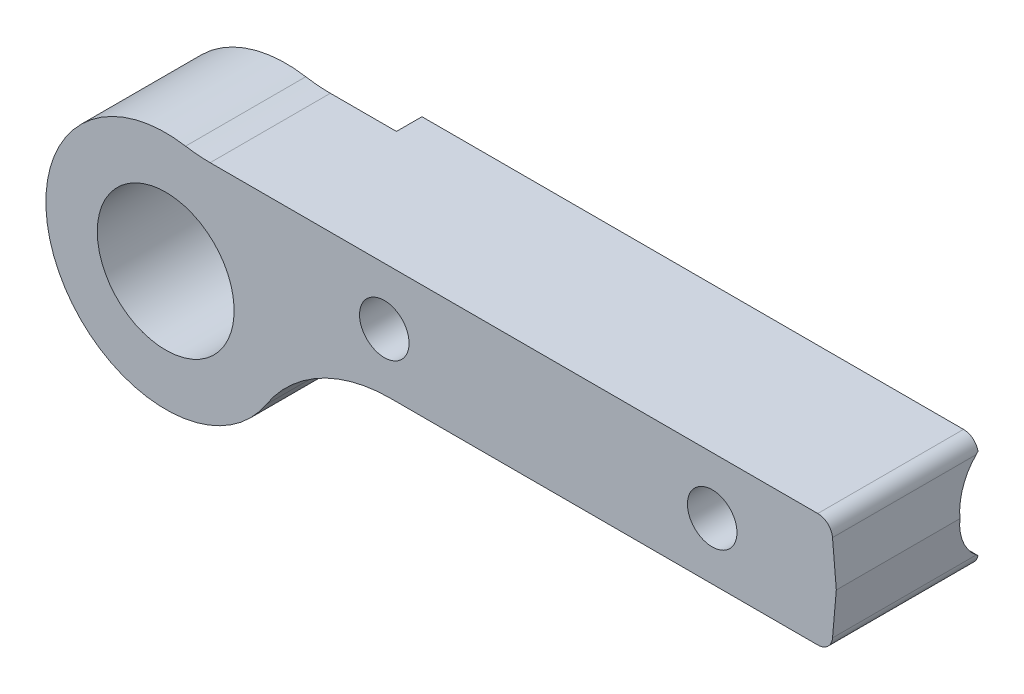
ISO-10303-21;
HEADER;
FILE_DESCRIPTION(('STEP AP214'),'2;1');
FILE_NAME('part.step','',(''),(''),'','','');
FILE_SCHEMA(('AUTOMOTIVE_DESIGN { 1 0 10303 214 1 1 1 1 }'));
ENDSEC;
DATA;
#1=APPLICATION_CONTEXT('core data for automotive mechanical design processes');
#2=APPLICATION_PROTOCOL_DEFINITION('international standard','automotive_design',2000,#1);
#3=PRODUCT_CONTEXT('',#1,'mechanical');
#4=PRODUCT('Part','Part','',(#3));
#5=PRODUCT_RELATED_PRODUCT_CATEGORY('part','',(#4));
#6=PRODUCT_DEFINITION_FORMATION('','',#4);
#7=PRODUCT_DEFINITION_CONTEXT('part definition',#1,'design');
#8=PRODUCT_DEFINITION('design','',#6,#7);
#9=PRODUCT_DEFINITION_SHAPE('','',#8);
#10=(LENGTH_UNIT() NAMED_UNIT(*) SI_UNIT(.MILLI.,.METRE.));
#11=(NAMED_UNIT(*) PLANE_ANGLE_UNIT() SI_UNIT($,.RADIAN.));
#12=(NAMED_UNIT(*) SI_UNIT($,.STERADIAN.) SOLID_ANGLE_UNIT());
#13=UNCERTAINTY_MEASURE_WITH_UNIT(LENGTH_MEASURE(1.E-05),#10,'distance_accuracy_value','');
#14=(GEOMETRIC_REPRESENTATION_CONTEXT(3) GLOBAL_UNCERTAINTY_ASSIGNED_CONTEXT((#13)) GLOBAL_UNIT_ASSIGNED_CONTEXT((#10,
#11,#12)) REPRESENTATION_CONTEXT('',''));
#15=CARTESIAN_POINT('',(0.,0.,0.));
#16=DIRECTION('',(0.,0.,1.));
#17=DIRECTION('',(1.,0.,0.));
#18=AXIS2_PLACEMENT_3D('',#15,#16,#17);
#19=CARTESIAN_POINT('',(30.8284770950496,-19.995,0.));
#20=DIRECTION('',(0.,0.,1.));
#21=DIRECTION('',(1.,0.,0.));
#22=AXIS2_PLACEMENT_3D('',#19,#20,#21);
#23=PLANE('',#22);
#24=CARTESIAN_POINT('',(0.,0.,0.));
#25=DIRECTION('',(0.,0.,-1.));
#26=DIRECTION('',(-1.,0.,0.));
#27=AXIS2_PLACEMENT_3D('',#24,#25,#26);
#28=CIRCLE('',#27,22.);
#29=CARTESIAN_POINT('',(21.9152168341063,1.92957796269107,0.));
#30=VERTEX_POINT('',#29);
#31=CARTESIAN_POINT('',(21.9303605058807,-1.74908206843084,0.));
#32=VERTEX_POINT('',#31);
#33=EDGE_CURVE('E145',#30,#32,#28,.T.);
#34=ORIENTED_EDGE('',*,*,#33,.F.);
#35=DIRECTION('',(1.,0.,0.));
#36=VECTOR('',#35,1.);
#37=CARTESIAN_POINT('',(-16.445,1.92957796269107,0.));
#38=LINE('',#37,#36);
#39=CARTESIAN_POINT('',(91.4789512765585,1.92957796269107,0.));
#40=VERTEX_POINT('',#39);
#41=EDGE_CURVE('E51',#30,#40,#38,.T.);
#42=ORIENTED_EDGE('',*,*,#41,.T.);
#43=CARTESIAN_POINT('',(89.4898477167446,2.335,0.));
#44=DIRECTION('',(0.,0.,1.));
#45=DIRECTION('',(1.,0.,0.));
#46=AXIS2_PLACEMENT_3D('',#43,#44,#45);
#47=CIRCLE('',#46,2.03);
#48=CARTESIAN_POINT('',(89.4898477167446,0.305,0.));
#49=VERTEX_POINT('',#48);
#50=EDGE_CURVE('E171',#49,#40,#47,.T.);
#51=ORIENTED_EDGE('',*,*,#50,.F.);
#52=DIRECTION('',(1.,0.,0.));
#53=VECTOR('',#52,1.);
#54=CARTESIAN_POINT('',(30.8284770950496,0.305,0.));
#55=LINE('',#54,#53);
#56=CARTESIAN_POINT('',(30.8284770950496,0.305,0.));
#57=VERTEX_POINT('',#56);
#58=EDGE_CURVE('E169',#57,#49,#55,.T.);
#59=ORIENTED_EDGE('',*,*,#58,.F.);
#60=CARTESIAN_POINT('',(30.8284770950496,-19.995,0.));
#61=DIRECTION('',(0.,0.,-1.));
#62=DIRECTION('',(1.,0.,0.));
#63=AXIS2_PLACEMENT_3D('',#60,#61,#62);
#64=CIRCLE('',#63,20.3);
#65=EDGE_CURVE('E167',#32,#57,#64,.T.);
#66=ORIENTED_EDGE('',*,*,#65,.F.);
#67=EDGE_LOOP('',(#34,#42,#51,#59,#66));
#68=FACE_BOUND('',#67,.T.);
#69=ADVANCED_FACE('F30',(#68),#23,.F.);
#70=CARTESIAN_POINT('',(6.10080322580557,36.235,20.));
#71=DIRECTION('',(0.,0.,-1.));
#72=DIRECTION('',(-1.,0.,0.));
#73=AXIS2_PLACEMENT_3D('',#70,#71,#72);
#74=CYLINDRICAL_SURFACE('',#73,20.3);
#75=CARTESIAN_POINT('',(6.10080322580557,36.235,3.5));
#76=DIRECTION('',(0.,0.,-1.));
#77=DIRECTION('',(-1.,0.,0.));
#78=AXIS2_PLACEMENT_3D('',#75,#76,#77);
#79=CIRCLE('',#78,20.3);
#80=CARTESIAN_POINT('',(2.73037716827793,16.216752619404,3.5));
#81=VERTEX_POINT('',#80);
#82=CARTESIAN_POINT('',(6.10080322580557,15.935,3.5));
#83=VERTEX_POINT('',#82);
#84=EDGE_CURVE('E161',#81,#83,#79,.F.);
#85=ORIENTED_EDGE('',*,*,#84,.F.);
#86=DIRECTION('',(0.,0.,-1.));
#87=VECTOR('',#86,1.);
#88=CARTESIAN_POINT('',(2.73037716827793,16.216752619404,20.));
#89=LINE('',#88,#87);
#90=CARTESIAN_POINT('',(2.73037716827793,16.216752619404,20.));
#91=VERTEX_POINT('',#90);
#92=EDGE_CURVE('E199',#91,#81,#89,.T.);
#93=ORIENTED_EDGE('',*,*,#92,.F.);
#94=CARTESIAN_POINT('',(6.10080322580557,36.235,20.));
#95=DIRECTION('',(0.,0.,-1.));
#96=DIRECTION('',(1.,0.,0.));
#97=AXIS2_PLACEMENT_3D('',#94,#95,#96);
#98=CIRCLE('',#97,20.3);
#99=CARTESIAN_POINT('',(6.10080322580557,15.935,20.));
#100=VERTEX_POINT('',#99);
#101=EDGE_CURVE('E192',#100,#91,#98,.T.);
#102=ORIENTED_EDGE('',*,*,#101,.F.);
#103=DIRECTION('',(0.,0.,-1.));
#104=VECTOR('',#103,1.);
#105=CARTESIAN_POINT('',(6.10080322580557,15.935,20.));
#106=LINE('',#105,#104);
#107=EDGE_CURVE('E202',#100,#83,#106,.T.);
#108=ORIENTED_EDGE('',*,*,#107,.T.);
#109=EDGE_LOOP('',(#85,#93,#102,#108));
#110=FACE_BOUND('',#109,.T.);
#111=ADVANCED_FACE('F280',(#110),#74,.F.);
#112=CARTESIAN_POINT('',(0.,0.,20.));
#113=DIRECTION('',(0.,0.,-1.));
#114=DIRECTION('',(-1.,0.,0.));
#115=AXIS2_PLACEMENT_3D('',#112,#113,#114);
#116=CYLINDRICAL_SURFACE('',#115,16.445);
#117=CARTESIAN_POINT('',(0.,0.,3.5));
#118=DIRECTION('',(0.,0.,-1.));
#119=DIRECTION('',(-1.,0.,0.));
#120=AXIS2_PLACEMENT_3D('',#117,#118,#119);
#121=CIRCLE('',#120,16.445);
#122=CARTESIAN_POINT('',(13.7970963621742,-8.94863995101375,3.5));
#123=VERTEX_POINT('',#122);
#124=EDGE_CURVE('E43',#123,#81,#121,.T.);
#125=ORIENTED_EDGE('',*,*,#124,.F.);
#126=DIRECTION('',(0.,0.,-1.));
#127=VECTOR('',#126,1.);
#128=CARTESIAN_POINT('',(13.7970963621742,-8.94863995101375,20.));
#129=LINE('',#128,#127);
#130=CARTESIAN_POINT('',(13.7970963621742,-8.94863995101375,20.));
#131=VERTEX_POINT('',#130);
#132=EDGE_CURVE('E196',#131,#123,#129,.T.);
#133=ORIENTED_EDGE('',*,*,#132,.F.);
#134=CARTESIAN_POINT('',(0.,0.,20.));
#135=DIRECTION('',(0.,0.,1.));
#136=DIRECTION('',(1.,0.,0.));
#137=AXIS2_PLACEMENT_3D('',#134,#135,#136);
#138=CIRCLE('',#137,16.445);
#139=EDGE_CURVE('E194',#91,#131,#138,.T.);
#140=ORIENTED_EDGE('',*,*,#139,.F.);
#141=ORIENTED_EDGE('',*,*,#92,.T.);
#142=EDGE_LOOP('',(#125,#133,#140,#141));
#143=FACE_BOUND('',#142,.T.);
#144=ADVANCED_FACE('F277',(#143),#116,.T.);
#145=CARTESIAN_POINT('',(30.8284770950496,-19.995,20.));
#146=DIRECTION('',(0.,0.,-1.));
#147=DIRECTION('',(-1.,0.,0.));
#148=AXIS2_PLACEMENT_3D('',#145,#146,#147);
#149=CYLINDRICAL_SURFACE('',#148,20.3);
#150=CARTESIAN_POINT('',(30.8284770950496,-19.995,3.5));
#151=DIRECTION('',(0.,0.,-1.));
#152=DIRECTION('',(-1.,0.,0.));
#153=AXIS2_PLACEMENT_3D('',#150,#151,#152);
#154=CIRCLE('',#153,20.3);
#155=CARTESIAN_POINT('',(21.9303605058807,-1.74908206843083,3.5));
#156=VERTEX_POINT('',#155);
#157=EDGE_CURVE('E165',#156,#123,#154,.F.);
#158=ORIENTED_EDGE('',*,*,#157,.F.);
#159=DIRECTION('',(0.,0.,-1.));
#160=VECTOR('',#159,1.);
#161=CARTESIAN_POINT('',(21.9303605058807,-1.74908206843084,1.75));
#162=LINE('',#161,#160);
#163=EDGE_CURVE('E158',#156,#32,#162,.T.);
#164=ORIENTED_EDGE('',*,*,#163,.T.);
#165=ORIENTED_EDGE('',*,*,#65,.T.);
#166=DIRECTION('',(0.,0.,-1.));
#167=VECTOR('',#166,1.);
#168=CARTESIAN_POINT('',(30.8284770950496,0.305,20.));
#169=LINE('',#168,#167);
#170=CARTESIAN_POINT('',(30.8284770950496,0.305,20.));
#171=VERTEX_POINT('',#170);
#172=EDGE_CURVE('E220',#171,#57,#169,.T.);
#173=ORIENTED_EDGE('',*,*,#172,.F.);
#174=CARTESIAN_POINT('',(30.8284770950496,-19.995,20.));
#175=DIRECTION('',(0.,0.,-1.));
#176=DIRECTION('',(1.,0.,0.));
#177=AXIS2_PLACEMENT_3D('',#174,#175,#176);
#178=CIRCLE('',#177,20.3);
#179=EDGE_CURVE('E177',#131,#171,#178,.T.);
#180=ORIENTED_EDGE('',*,*,#179,.F.);
#181=ORIENTED_EDGE('',*,*,#132,.T.);
#182=EDGE_LOOP('',(#158,#164,#165,#173,#180,#181));
#183=FACE_BOUND('',#182,.T.);
#184=ADVANCED_FACE('F32',(#183),#149,.F.);
#185=CARTESIAN_POINT('',(30.8284770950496,0.305,20.));
#186=DIRECTION('',(0.,1.,0.));
#187=DIRECTION('',(0.,0.,1.));
#188=AXIS2_PLACEMENT_3D('',#185,#186,#187);
#189=PLANE('',#188);
#190=ORIENTED_EDGE('',*,*,#58,.T.);
#191=DIRECTION('',(0.,0.,-1.));
#192=VECTOR('',#191,1.);
#193=CARTESIAN_POINT('',(89.4898477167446,0.305,20.));
#194=LINE('',#193,#192);
#195=CARTESIAN_POINT('',(89.4898477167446,0.305,20.));
#196=VERTEX_POINT('',#195);
#197=EDGE_CURVE('E217',#196,#49,#194,.T.);
#198=ORIENTED_EDGE('',*,*,#197,.F.);
#199=DIRECTION('',(1.,0.,0.));
#200=VECTOR('',#199,1.);
#201=CARTESIAN_POINT('',(30.8284770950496,0.305,20.));
#202=LINE('',#201,#200);
#203=EDGE_CURVE('E180',#171,#196,#202,.T.);
#204=ORIENTED_EDGE('',*,*,#203,.F.);
#205=ORIENTED_EDGE('',*,*,#172,.T.);
#206=EDGE_LOOP('',(#190,#198,#204,#205));
#207=FACE_BOUND('',#206,.T.);
#208=ADVANCED_FACE('F270',(#207),#189,.F.);
#209=CARTESIAN_POINT('',(89.4898477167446,2.335,20.));
#210=DIRECTION('',(0.,0.,-1.));
#211=DIRECTION('',(-1.,0.,0.));
#212=AXIS2_PLACEMENT_3D('',#209,#210,#211);
#213=CYLINDRICAL_SURFACE('',#212,2.03);
#214=ORIENTED_EDGE('',*,*,#50,.T.);
#215=CARTESIAN_POINT('',(91.4789512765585,1.92957796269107,0.));
#216=CARTESIAN_POINT('',(91.4827079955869,1.94800984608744,0.0239206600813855));
#217=CARTESIAN_POINT('',(91.4862300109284,1.96659848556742,0.0477578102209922));
#218=CARTESIAN_POINT('',(91.4927834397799,2.00407655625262,0.0952461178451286));
#219=CARTESIAN_POINT('',(91.4958150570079,2.0229658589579,0.11889734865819));
#220=CARTESIAN_POINT('',(91.5013696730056,2.06104800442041,0.166014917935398));
#221=CARTESIAN_POINT('',(91.5038926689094,2.08024084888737,0.189481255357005));
#222=CARTESIAN_POINT('',(91.5084100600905,2.11893179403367,0.23622878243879));
#223=CARTESIAN_POINT('',(91.5104042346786,2.13843001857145,0.259509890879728));
#224=CARTESIAN_POINT('',(91.5121229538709,2.15807384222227,0.28268854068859));
#225=B_SPLINE_CURVE_WITH_KNOTS('',3,(#215,#216,#217,#218,#219,#220,#221,#222,#223,#224),
.UNSPECIFIED.,.F.,.F.,(4,2,2,2,4),(0.,0.0912920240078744,0.18254602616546,0.273800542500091,
0.365093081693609),.UNSPECIFIED.);
#226=CARTESIAN_POINT('',(91.5121229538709,2.15807384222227,0.282688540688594));
#227=VERTEX_POINT('',#226);
#228=EDGE_CURVE('E149',#40,#227,#225,.T.);
#229=ORIENTED_EDGE('',*,*,#228,.T.);
#230=DIRECTION('',(0.,0.,-1.));
#231=VECTOR('',#230,1.);
#232=CARTESIAN_POINT('',(91.5121229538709,2.15807384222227,20.));
#233=LINE('',#232,#231);
#234=CARTESIAN_POINT('',(91.5121229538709,2.15807384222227,20.));
#235=VERTEX_POINT('',#234);
#236=EDGE_CURVE('E214',#235,#227,#233,.T.);
#237=ORIENTED_EDGE('',*,*,#236,.F.);
#238=CARTESIAN_POINT('',(89.4898477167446,2.335,20.));
#239=DIRECTION('',(0.,0.,1.));
#240=DIRECTION('',(1.,0.,0.));
#241=AXIS2_PLACEMENT_3D('',#238,#239,#240);
#242=CIRCLE('',#241,2.03);
#243=EDGE_CURVE('E182',#196,#235,#242,.T.);
#244=ORIENTED_EDGE('',*,*,#243,.F.);
#245=ORIENTED_EDGE('',*,*,#197,.T.);
#246=EDGE_LOOP('',(#214,#229,#237,#244,#245));
#247=FACE_BOUND('',#246,.T.);
#248=ADVANCED_FACE('F266',(#247),#213,.T.);
#249=CARTESIAN_POINT('',(91.5121229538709,2.15807384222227,20.));
#250=DIRECTION('',(-0.996194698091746,0.0871557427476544,0.));
#251=DIRECTION('',(-0.0871557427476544,-0.996194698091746,0.));
#252=AXIS2_PLACEMENT_3D('',#249,#250,#251);
#253=PLANE('',#252);
#254=ORIENTED_EDGE('',*,*,#236,.T.);
#255=CARTESIAN_POINT('',(92.0337239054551,8.12,-4.77));
#256=DIRECTION('',(-0.996194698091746,0.0871557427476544,0.));
#257=DIRECTION('',(0.0871557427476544,0.996194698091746,0.));
#258=AXIS2_PLACEMENT_3D('',#255,#256,#257);
#259=ELLIPSE('',#258,7.84485203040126,7.815);
#260=CARTESIAN_POINT('',(92.0337239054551,8.12,3.04500000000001));
#261=VERTEX_POINT('',#260);
#262=EDGE_CURVE('E328',#227,#261,#259,.T.);
#263=ORIENTED_EDGE('',*,*,#262,.T.);
#264=DIRECTION('',(0.,0.,-1.));
#265=VECTOR('',#264,1.);
#266=CARTESIAN_POINT('',(92.0337239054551,8.12,20.));
#267=LINE('',#266,#265);
#268=CARTESIAN_POINT('',(92.0337239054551,8.12,20.));
#269=VERTEX_POINT('',#268);
#270=EDGE_CURVE('E211',#269,#261,#267,.T.);
#271=ORIENTED_EDGE('',*,*,#270,.F.);
#272=DIRECTION('',(0.0871557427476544,0.996194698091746,0.));
#273=VECTOR('',#272,1.);
#274=CARTESIAN_POINT('',(91.5121229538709,2.15807384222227,20.));
#275=LINE('',#274,#273);
#276=EDGE_CURVE('E184',#235,#269,#275,.T.);
#277=ORIENTED_EDGE('',*,*,#276,.F.);
#278=EDGE_LOOP('',(#254,#263,#271,#277));
#279=FACE_BOUND('',#278,.T.);
#280=ADVANCED_FACE('F263',(#279),#253,.F.);
#281=CARTESIAN_POINT('',(91.5121229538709,14.0819261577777,20.));
#282=DIRECTION('',(-0.996194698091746,-0.0871557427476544,0.));
#283=DIRECTION('',(0.0871557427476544,-0.996194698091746,0.));
#284=AXIS2_PLACEMENT_3D('',#281,#282,#283);
#285=PLANE('',#284);
#286=ORIENTED_EDGE('',*,*,#270,.T.);
#287=CARTESIAN_POINT('',(92.0337239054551,8.12,-4.77));
#288=DIRECTION('',(-0.996194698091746,-0.0871557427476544,0.));
#289=DIRECTION('',(0.0871557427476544,-0.996194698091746,0.));
#290=AXIS2_PLACEMENT_3D('',#287,#288,#289);
#291=ELLIPSE('',#290,7.84485203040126,7.815);
#292=CARTESIAN_POINT('',(91.5121229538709,14.0819261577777,0.282688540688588));
#293=VERTEX_POINT('',#292);
#294=EDGE_CURVE('E251',#261,#293,#291,.T.);
#295=ORIENTED_EDGE('',*,*,#294,.T.);
#296=DIRECTION('',(0.,0.,-1.));
#297=VECTOR('',#296,1.);
#298=CARTESIAN_POINT('',(91.5121229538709,14.0819261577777,20.));
#299=LINE('',#298,#297);
#300=CARTESIAN_POINT('',(91.5121229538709,14.0819261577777,20.));
#301=VERTEX_POINT('',#300);
#302=EDGE_CURVE('E208',#301,#293,#299,.T.);
#303=ORIENTED_EDGE('',*,*,#302,.F.);
#304=DIRECTION('',(-0.0871557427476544,0.996194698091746,0.));
#305=VECTOR('',#304,1.);
#306=CARTESIAN_POINT('',(91.5121229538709,14.0819261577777,20.));
#307=LINE('',#306,#305);
#308=EDGE_CURVE('E186',#269,#301,#307,.T.);
#309=ORIENTED_EDGE('',*,*,#308,.F.);
#310=EDGE_LOOP('',(#286,#295,#303,#309));
#311=FACE_BOUND('',#310,.T.);
#312=ADVANCED_FACE('F258',(#311),#285,.F.);
#313=CARTESIAN_POINT('',(89.4898477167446,13.905,20.));
#314=DIRECTION('',(0.,0.,-1.));
#315=DIRECTION('',(-1.,0.,0.));
#316=AXIS2_PLACEMENT_3D('',#313,#314,#315);
#317=CYLINDRICAL_SURFACE('',#316,2.03);
#318=ORIENTED_EDGE('',*,*,#302,.T.);
#319=CARTESIAN_POINT('',(91.5121229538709,14.0819261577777,0.282688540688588));
#320=CARTESIAN_POINT('',(91.5104042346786,14.1015699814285,0.259509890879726));
#321=CARTESIAN_POINT('',(91.5084100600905,14.1210682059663,0.236228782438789));
#322=CARTESIAN_POINT('',(91.5038926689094,14.1597591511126,0.189481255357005));
#323=CARTESIAN_POINT('',(91.5013696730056,14.1789519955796,0.166014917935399));
#324=CARTESIAN_POINT('',(91.4958150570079,14.2170341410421,0.118897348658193));
#325=CARTESIAN_POINT('',(91.4927834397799,14.2359234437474,0.0952461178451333));
#326=CARTESIAN_POINT('',(91.4862300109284,14.2734015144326,0.0477578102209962));
#327=CARTESIAN_POINT('',(91.482707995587,14.2919901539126,0.0239206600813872));
#328=CARTESIAN_POINT('',(91.4789512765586,14.3104220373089,0.));
#329=B_SPLINE_CURVE_WITH_KNOTS('',3,(#319,#320,#321,#322,#323,#324,#325,#326,#327,#328),
.UNSPECIFIED.,.F.,.F.,(4,2,2,2,4),(0.,0.0912925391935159,0.182547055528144,0.273801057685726,
0.3650930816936),.UNSPECIFIED.);
#330=CARTESIAN_POINT('',(91.4789512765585,14.3104220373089,0.));
#331=VERTEX_POINT('',#330);
#332=EDGE_CURVE('E244',#293,#331,#329,.T.);
#333=ORIENTED_EDGE('',*,*,#332,.T.);
#334=CARTESIAN_POINT('',(89.4898477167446,13.905,0.));
#335=DIRECTION('',(0.,0.,1.));
#336=DIRECTION('',(-1.,0.,0.));
#337=AXIS2_PLACEMENT_3D('',#334,#335,#336);
#338=CIRCLE('',#337,2.03);
#339=CARTESIAN_POINT('',(89.4898477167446,15.935,0.));
#340=VERTEX_POINT('',#339);
#341=EDGE_CURVE('E140',#331,#340,#338,.T.);
#342=ORIENTED_EDGE('',*,*,#341,.T.);
#343=DIRECTION('',(0.,0.,-1.));
#344=VECTOR('',#343,1.);
#345=CARTESIAN_POINT('',(89.4898477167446,15.935,20.));
#346=LINE('',#345,#344);
#347=CARTESIAN_POINT('',(89.4898477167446,15.935,20.));
#348=VERTEX_POINT('',#347);
#349=EDGE_CURVE('E205',#348,#340,#346,.T.);
#350=ORIENTED_EDGE('',*,*,#349,.F.);
#351=CARTESIAN_POINT('',(89.4898477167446,13.905,20.));
#352=DIRECTION('',(0.,0.,1.));
#353=DIRECTION('',(-1.,0.,0.));
#354=AXIS2_PLACEMENT_3D('',#351,#352,#353);
#355=CIRCLE('',#354,2.03);
#356=EDGE_CURVE('E188',#301,#348,#355,.T.);
#357=ORIENTED_EDGE('',*,*,#356,.F.);
#358=EDGE_LOOP('',(#318,#333,#342,#350,#357));
#359=FACE_BOUND('',#358,.T.);
#360=ADVANCED_FACE('F252',(#359),#317,.T.);
#361=CARTESIAN_POINT('',(6.10080322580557,15.935,20.));
#362=DIRECTION('',(0.,-1.,0.));
#363=DIRECTION('',(0.,0.,-1.));
#364=AXIS2_PLACEMENT_3D('',#361,#362,#363);
#365=PLANE('',#364);
#366=DIRECTION('',(-1.,0.,0.));
#367=VECTOR('',#366,1.);
#368=CARTESIAN_POINT('',(6.10080322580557,15.935,0.));
#369=LINE('',#368,#367);
#370=CARTESIAN_POINT('',(15.1682489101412,15.935,0.));
#371=VERTEX_POINT('',#370);
#372=EDGE_CURVE('E175',#340,#371,#369,.T.);
#373=ORIENTED_EDGE('',*,*,#372,.T.);
#374=DIRECTION('',(0.,0.,-1.));
#375=VECTOR('',#374,1.);
#376=CARTESIAN_POINT('',(15.1682489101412,15.935,3.5));
#377=LINE('',#376,#375);
#378=CARTESIAN_POINT('',(15.1682489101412,15.935,3.5));
#379=VERTEX_POINT('',#378);
#380=EDGE_CURVE('E58',#371,#379,#377,.F.);
#381=ORIENTED_EDGE('',*,*,#380,.T.);
#382=DIRECTION('',(1.,0.,0.));
#383=VECTOR('',#382,1.);
#384=CARTESIAN_POINT('',(6.10080322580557,15.935,3.5));
#385=LINE('',#384,#383);
#386=EDGE_CURVE('E163',#83,#379,#385,.T.);
#387=ORIENTED_EDGE('',*,*,#386,.F.);
#388=ORIENTED_EDGE('',*,*,#107,.F.);
#389=DIRECTION('',(-1.,0.,0.));
#390=VECTOR('',#389,1.);
#391=CARTESIAN_POINT('',(6.10080322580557,15.935,20.));
#392=LINE('',#391,#390);
#393=EDGE_CURVE('E190',#348,#100,#392,.T.);
#394=ORIENTED_EDGE('',*,*,#393,.F.);
#395=ORIENTED_EDGE('',*,*,#349,.T.);
#396=EDGE_LOOP('',(#373,#381,#387,#388,#394,#395));
#397=FACE_BOUND('',#396,.T.);
#398=ADVANCED_FACE('F257',(#397),#365,.F.);
#399=CARTESIAN_POINT('',(30.8284770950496,-19.995,20.));
#400=DIRECTION('',(0.,0.,1.));
#401=DIRECTION('',(1.,0.,0.));
#402=AXIS2_PLACEMENT_3D('',#399,#400,#401);
#403=PLANE('',#402);
#404=CARTESIAN_POINT('',(30.,8.12,20.));
#405=DIRECTION('',(0.,0.,1.));
#406=DIRECTION('',(1.,0.,0.));
#407=AXIS2_PLACEMENT_3D('',#404,#405,#406);
#408=CIRCLE('',#407,3.39999999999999);
#409=CARTESIAN_POINT('',(33.4,8.12,20.));
#410=VERTEX_POINT('',#409);
#411=EDGE_CURVE('E443',#410,#410,#408,.T.);
#412=ORIENTED_EDGE('',*,*,#411,.F.);
#413=EDGE_LOOP('',(#412));
#414=FACE_BOUND('',#413,.T.);
#415=CARTESIAN_POINT('',(75.,8.12,20.));
#416=DIRECTION('',(0.,0.,1.));
#417=DIRECTION('',(1.,0.,0.));
#418=AXIS2_PLACEMENT_3D('',#415,#416,#417);
#419=CIRCLE('',#418,3.39999999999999);
#420=CARTESIAN_POINT('',(78.4,8.12,20.));
#421=VERTEX_POINT('',#420);
#422=EDGE_CURVE('E446',#421,#421,#419,.T.);
#423=ORIENTED_EDGE('',*,*,#422,.F.);
#424=EDGE_LOOP('',(#423));
#425=FACE_BOUND('',#424,.T.);
#426=CARTESIAN_POINT('',(0.,0.,20.));
#427=DIRECTION('',(0.,0.,-1.));
#428=DIRECTION('',(-1.,0.,0.));
#429=AXIS2_PLACEMENT_3D('',#426,#427,#428);
#430=CIRCLE('',#429,9.39);
#431=CARTESIAN_POINT('',(-9.39,0.,20.));
#432=VERTEX_POINT('',#431);
#433=EDGE_CURVE('E141',#432,#432,#430,.T.);
#434=ORIENTED_EDGE('',*,*,#433,.T.);
#435=EDGE_LOOP('',(#434));
#436=FACE_BOUND('',#435,.T.);
#437=ORIENTED_EDGE('',*,*,#179,.T.);
#438=ORIENTED_EDGE('',*,*,#203,.T.);
#439=ORIENTED_EDGE('',*,*,#243,.T.);
#440=ORIENTED_EDGE('',*,*,#276,.T.);
#441=ORIENTED_EDGE('',*,*,#308,.T.);
#442=ORIENTED_EDGE('',*,*,#356,.T.);
#443=ORIENTED_EDGE('',*,*,#393,.T.);
#444=ORIENTED_EDGE('',*,*,#101,.T.);
#445=ORIENTED_EDGE('',*,*,#139,.T.);
#446=EDGE_LOOP('',(#437,#438,#439,#440,#441,#442,#443,#444,#445));
#447=FACE_BOUND('',#446,.T.);
#448=ADVANCED_FACE('F288',(#414,#425,#436,#447),#403,.T.);
#449=ORIENTED_EDGE('',*,*,#341,.F.);
#450=DIRECTION('',(1.,0.,0.));
#451=VECTOR('',#450,1.);
#452=CARTESIAN_POINT('',(-16.445,14.3104220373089,0.));
#453=LINE('',#452,#451);
#454=CARTESIAN_POINT('',(16.7096325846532,14.3104220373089,0.));
#455=VERTEX_POINT('',#454);
#456=EDGE_CURVE('E131',#331,#455,#453,.F.);
#457=ORIENTED_EDGE('',*,*,#456,.T.);
#458=EDGE_CURVE('E138',#371,#455,#28,.T.);
#459=ORIENTED_EDGE('',*,*,#458,.F.);
#460=ORIENTED_EDGE('',*,*,#372,.F.);
#461=EDGE_LOOP('',(#449,#457,#459,#460));
#462=FACE_BOUND('',#461,.T.);
#463=ADVANCED_FACE('F136',(#462),#23,.F.);
#464=CARTESIAN_POINT('',(0.,0.,3.5));
#465=DIRECTION('',(0.,0.,-1.));
#466=DIRECTION('',(-1.,0.,0.));
#467=AXIS2_PLACEMENT_3D('',#464,#465,#466);
#468=PLANE('',#467);
#469=CARTESIAN_POINT('',(0.,0.,3.5));
#470=DIRECTION('',(0.,0.,-1.));
#471=DIRECTION('',(-1.,0.,0.));
#472=AXIS2_PLACEMENT_3D('',#469,#470,#471);
#473=CIRCLE('',#472,9.39);
#474=CARTESIAN_POINT('',(-9.39,0.,3.5));
#475=VERTEX_POINT('',#474);
#476=EDGE_CURVE('E451',#475,#475,#473,.T.);
#477=ORIENTED_EDGE('',*,*,#476,.F.);
#478=EDGE_LOOP('',(#477));
#479=FACE_BOUND('',#478,.T.);
#480=ORIENTED_EDGE('',*,*,#157,.T.);
#481=ORIENTED_EDGE('',*,*,#124,.T.);
#482=ORIENTED_EDGE('',*,*,#84,.T.);
#483=ORIENTED_EDGE('',*,*,#386,.T.);
#484=CARTESIAN_POINT('',(0.,0.,3.5));
#485=DIRECTION('',(0.,0.,-1.));
#486=DIRECTION('',(-1.,0.,0.));
#487=AXIS2_PLACEMENT_3D('',#484,#485,#486);
#488=CIRCLE('',#487,22.);
#489=EDGE_CURVE('E144',#379,#156,#488,.T.);
#490=ORIENTED_EDGE('',*,*,#489,.T.);
#491=EDGE_LOOP('',(#480,#481,#482,#483,#490));
#492=FACE_BOUND('',#491,.T.);
#493=ADVANCED_FACE('F238',(#479,#492),#468,.T.);
#494=CARTESIAN_POINT('',(0.,0.,3.5));
#495=DIRECTION('',(0.,0.,-1.));
#496=DIRECTION('',(-1.,0.,0.));
#497=AXIS2_PLACEMENT_3D('',#494,#495,#496);
#498=CYLINDRICAL_SURFACE('',#497,22.);
#499=ORIENTED_EDGE('',*,*,#458,.T.);
#500=CARTESIAN_POINT('',(20.4466525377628,8.12,-12.585));
#501=CARTESIAN_POINT('',(20.3510161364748,8.36081444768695,-12.5849987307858));
#502=CARTESIAN_POINT('',(20.251106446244,8.59996062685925,-12.5738600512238));
#503=CARTESIAN_POINT('',(20.0436542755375,9.07296381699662,-12.5303176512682));
#504=CARTESIAN_POINT('',(19.9361099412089,9.30681952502,-12.4979087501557));
#505=CARTESIAN_POINT('',(19.7143688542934,9.76775861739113,-12.4129099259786));
#506=CARTESIAN_POINT('',(19.6001682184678,9.99483792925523,-12.3603081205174));
#507=CARTESIAN_POINT('',(19.366248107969,10.4408758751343,-12.2360156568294));
#508=CARTESIAN_POINT('',(19.2465264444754,10.6598312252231,-12.1643173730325));
#509=CARTESIAN_POINT('',(19.0035339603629,11.0871888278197,-12.0033834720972));
#510=CARTESIAN_POINT('',(18.8802891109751,11.2956470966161,-11.9142570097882));
#511=CARTESIAN_POINT('',(18.6307896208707,11.7025913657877,-11.7191142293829));
#512=CARTESIAN_POINT('',(18.5045350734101,11.9010776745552,-11.6130984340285));
#513=CARTESIAN_POINT('',(18.250160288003,12.2876049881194,-11.3848116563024));
#514=CARTESIAN_POINT('',(18.1220380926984,12.4756338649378,-11.2625223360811));
#515=CARTESIAN_POINT('',(17.8655012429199,12.8403099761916,-11.0024194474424));
#516=CARTESIAN_POINT('',(17.737086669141,13.0169600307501,-10.8646097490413));
#517=CARTESIAN_POINT('',(17.4669484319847,13.377669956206,-10.5573529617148));
#518=CARTESIAN_POINT('',(17.3253678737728,13.5602963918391,-10.3860903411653));
#519=CARTESIAN_POINT('',(17.046088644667,13.9097414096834,-10.025117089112));
#520=CARTESIAN_POINT('',(16.9083909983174,14.0765558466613,-9.83540164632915));
#521=CARTESIAN_POINT('',(16.6399937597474,14.392829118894,-9.43799671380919));
#522=CARTESIAN_POINT('',(16.5092831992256,14.5423156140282,-9.23033681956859));
#523=CARTESIAN_POINT('',(16.2582115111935,14.8224811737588,-8.79710149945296));
#524=CARTESIAN_POINT('',(16.1378438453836,14.9531721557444,-8.5715375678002));
#525=CARTESIAN_POINT('',(15.8821697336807,15.2249742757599,-8.04161826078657));
#526=CARTESIAN_POINT('',(15.7510556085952,15.3600329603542,-7.73197659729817));
#527=CARTESIAN_POINT('',(15.5793608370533,15.5335183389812,-7.24857173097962));
#528=CARTESIAN_POINT('',(15.5262970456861,15.5864915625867,-7.08430138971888));
#529=CARTESIAN_POINT('',(15.4298210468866,15.6820030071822,-6.75002638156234));
#530=CARTESIAN_POINT('',(15.3864038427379,15.7245466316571,-6.58002473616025));
#531=CARTESIAN_POINT('',(15.3100868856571,15.7988646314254,-6.23323726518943));
#532=CARTESIAN_POINT('',(15.2773117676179,15.8305116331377,-6.05639642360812));
#533=CARTESIAN_POINT('',(15.2241227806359,15.8816704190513,-5.69911312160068));
#534=CARTESIAN_POINT('',(15.203708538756,15.9011825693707,-5.51867077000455));
#535=CARTESIAN_POINT('',(15.1760549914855,15.9275775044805,-5.15599190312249));
#536=CARTESIAN_POINT('',(15.1688055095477,15.9344700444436,-4.97375688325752));
#537=CARTESIAN_POINT('',(15.1677543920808,15.9354708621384,-4.60922286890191));
#538=CARTESIAN_POINT('',(15.1739512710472,15.9295805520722,-4.42692388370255));
#539=CARTESIAN_POINT('',(15.1976443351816,15.906973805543,-4.09077631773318));
#540=CARTESIAN_POINT('',(15.2133485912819,15.8919732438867,-3.93667912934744));
#541=CARTESIAN_POINT('',(15.2538950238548,15.8530589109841,-3.63079004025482));
#542=CARTESIAN_POINT('',(15.278739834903,15.8291425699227,-3.47899881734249));
#543=CARTESIAN_POINT('',(15.336913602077,15.7727840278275,-3.1786217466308));
#544=CARTESIAN_POINT('',(15.3702453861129,15.7403389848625,-3.03003698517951));
#545=CARTESIAN_POINT('',(15.4445913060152,15.6673963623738,-2.7368072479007));
#546=CARTESIAN_POINT('',(15.4856072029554,15.6268969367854,-2.59216318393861));
#547=CARTESIAN_POINT('',(15.589827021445,15.5230285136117,-2.25809514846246));
#548=CARTESIAN_POINT('',(15.6557991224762,15.4565939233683,-2.07048118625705));
#549=CARTESIAN_POINT('',(15.7979670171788,15.3112561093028,-1.70423708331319));
#550=CARTESIAN_POINT('',(15.8741633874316,15.2323521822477,-1.52560745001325));
#551=CARTESIAN_POINT('',(16.0349680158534,15.0629829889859,-1.17740100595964));
#552=CARTESIAN_POINT('',(16.1195923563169,14.9724955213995,-1.00784249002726));
#553=CARTESIAN_POINT('',(16.2953600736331,14.7810061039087,-0.678357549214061));
#554=CARTESIAN_POINT('',(16.3865036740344,14.6800037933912,-0.518431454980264));
#555=CARTESIAN_POINT('',(16.6037295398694,14.4343661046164,-0.158662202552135));
#556=CARTESIAN_POINT('',(16.7316655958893,14.2861049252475,0.037595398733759));
#557=CARTESIAN_POINT('',(16.9932443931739,13.973945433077,0.413164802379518));
#558=CARTESIAN_POINT('',(17.1268888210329,13.810042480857,0.592471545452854));
#559=CARTESIAN_POINT('',(17.3974424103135,13.4676141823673,0.934010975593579));
#560=CARTESIAN_POINT('',(17.5343529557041,13.2890825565,1.09623626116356));
#561=CARTESIAN_POINT('',(17.809248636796,12.9183558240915,1.40316040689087));
#562=CARTESIAN_POINT('',(17.9472336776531,12.7261619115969,1.54786079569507));
#563=CARTESIAN_POINT('',(18.2240125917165,12.3266014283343,1.82074524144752));
#564=CARTESIAN_POINT('',(18.3627975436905,12.1190859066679,1.94872043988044));
#565=CARTESIAN_POINT('',(18.6378203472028,11.6917157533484,2.1853375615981));
#566=CARTESIAN_POINT('',(18.7740583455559,11.471861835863,2.29398060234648));
#567=CARTESIAN_POINT('',(19.0423393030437,11.0208051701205,2.49085989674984));
#568=CARTESIAN_POINT('',(19.1743832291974,10.7896050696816,2.57910088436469));
#569=CARTESIAN_POINT('',(19.4327689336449,10.3169768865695,2.73395536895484));
#570=CARTESIAN_POINT('',(19.5591108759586,10.0755490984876,2.8005694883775));
#571=CARTESIAN_POINT('',(19.804356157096,9.58449829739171,2.91066574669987));
#572=CARTESIAN_POINT('',(19.9232761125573,9.33489564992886,2.95420132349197));
#573=CARTESIAN_POINT('',(20.1526573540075,8.82879221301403,3.01696642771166));
#574=CARTESIAN_POINT('',(20.2631184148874,8.57229124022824,3.03619530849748));
#575=CARTESIAN_POINT('',(20.4742825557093,8.05492025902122,3.04900764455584));
#576=CARTESIAN_POINT('',(20.5749946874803,7.79405457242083,3.04261512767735));
#577=CARTESIAN_POINT('',(20.7657862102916,7.27046781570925,3.00312041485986));
#578=CARTESIAN_POINT('',(20.8558677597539,7.00774713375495,2.97002365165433));
#579=CARTESIAN_POINT('',(21.012640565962,6.52109398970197,2.88309041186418));
#580=CARTESIAN_POINT('',(21.080834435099,6.29698905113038,2.83289805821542));
#581=CARTESIAN_POINT('',(21.2087104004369,5.85185441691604,2.71217198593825));
#582=CARTESIAN_POINT('',(21.2683934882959,5.63082436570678,2.64164064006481));
#583=CARTESIAN_POINT('',(21.3792237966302,5.19418094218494,2.48037601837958));
#584=CARTESIAN_POINT('',(21.4303750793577,4.97856503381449,2.38965240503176));
#585=CARTESIAN_POINT('',(21.5244024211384,4.55490704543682,2.18839927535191));
#586=CARTESIAN_POINT('',(21.5672789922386,4.34686449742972,2.07787098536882));
#587=CARTESIAN_POINT('',(21.6413000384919,3.96091020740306,1.8497663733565));
#588=CARTESIAN_POINT('',(21.673189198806,3.78206668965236,1.73400236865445));
#589=CARTESIAN_POINT('',(21.7310846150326,3.43381958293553,1.48774795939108));
#590=CARTESIAN_POINT('',(21.7570911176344,3.26441559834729,1.35725817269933));
#591=CARTESIAN_POINT('',(21.8037736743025,2.93647615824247,1.08244155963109));
#592=CARTESIAN_POINT('',(21.8244502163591,2.77793970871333,0.938116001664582));
#593=CARTESIAN_POINT('',(21.8611041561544,2.47299727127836,0.636621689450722));
#594=CARTESIAN_POINT('',(21.877081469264,2.32659150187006,0.4794527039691));
#595=CARTESIAN_POINT('',(21.9048540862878,2.04857948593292,0.155159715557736));
#596=CARTESIAN_POINT('',(21.9166929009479,1.91682984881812,-0.0118377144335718));
#597=CARTESIAN_POINT('',(21.9370905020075,1.66725737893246,-0.356206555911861));
#598=CARTESIAN_POINT('',(21.9456481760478,1.54943927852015,-0.533581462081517));
#599=CARTESIAN_POINT('',(21.9601219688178,1.32864135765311,-0.897410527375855));
#600=CARTESIAN_POINT('',(21.9660383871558,1.22565985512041,-1.08386365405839));
#601=CARTESIAN_POINT('',(21.9758362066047,1.03523757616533,-1.46459922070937));
#602=CARTESIAN_POINT('',(21.979717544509,0.947797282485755,-1.65888190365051));
#603=CARTESIAN_POINT('',(21.9860539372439,0.78740904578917,-2.05807077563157));
#604=CARTESIAN_POINT('',(21.9884776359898,0.714800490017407,-2.26311389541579));
#605=CARTESIAN_POINT('',(21.9922627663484,0.586919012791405,-2.67855208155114));
#606=CARTESIAN_POINT('',(21.9936241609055,0.531646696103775,-2.88894733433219));
#607=CARTESIAN_POINT('',(21.9956718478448,0.438835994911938,-3.31357739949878));
#608=CARTESIAN_POINT('',(21.996358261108,0.401294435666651,-3.52781151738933));
#609=CARTESIAN_POINT('',(21.9973261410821,0.344180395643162,-3.95875482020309));
#610=CARTESIAN_POINT('',(21.9976074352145,0.324615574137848,-4.17546502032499));
#611=CARTESIAN_POINT('',(21.9979088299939,0.303515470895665,-4.61190472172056));
#612=CARTESIAN_POINT('',(21.9979263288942,0.302159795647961,-4.83164292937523));
#613=CARTESIAN_POINT('',(21.9977037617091,0.317947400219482,-5.27036133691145));
#614=CARTESIAN_POINT('',(21.9974638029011,0.335082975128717,-5.48934181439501));
#615=CARTESIAN_POINT('',(21.9965988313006,0.387726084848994,-5.92514086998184));
#616=CARTESIAN_POINT('',(21.9959737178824,0.423238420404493,-6.14195886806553));
#617=CARTESIAN_POINT('',(21.994077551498,0.512384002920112,-6.57182861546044));
#618=CARTESIAN_POINT('',(21.9928065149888,0.566016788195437,-6.78488046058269));
#619=CARTESIAN_POINT('',(21.9892322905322,0.691068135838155,-7.20586732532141));
#620=CARTESIAN_POINT('',(21.9869283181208,0.762500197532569,-7.41379832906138));
#621=CARTESIAN_POINT('',(21.980791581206,0.922613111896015,-7.82288258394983));
#622=CARTESIAN_POINT('',(21.9769588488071,1.01129360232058,-8.02403597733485));
#623=CARTESIAN_POINT('',(21.9671740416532,1.2052768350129,-8.41816101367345));
#624=CARTESIAN_POINT('',(21.9612215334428,1.31058297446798,-8.61113097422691));
#625=CARTESIAN_POINT('',(21.9465386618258,1.53697644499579,-8.98736983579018));
#626=CARTESIAN_POINT('',(21.9378093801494,1.65805761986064,-9.17064248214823));
#627=CARTESIAN_POINT('',(21.9169185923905,1.91445339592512,-9.52531864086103));
#628=CARTESIAN_POINT('',(21.904774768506,2.04969247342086,-9.6967777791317));
#629=CARTESIAN_POINT('',(21.8763232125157,2.33385170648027,-10.0275904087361));
#630=CARTESIAN_POINT('',(21.8600154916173,2.48277182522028,-10.186943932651));
#631=CARTESIAN_POINT('',(21.82253858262,2.79306645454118,-10.4923584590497));
#632=CARTESIAN_POINT('',(21.8013701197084,2.95443910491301,-10.6384214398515));
#633=CARTESIAN_POINT('',(21.7535161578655,3.28830719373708,-10.9162287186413));
#634=CARTESIAN_POINT('',(21.7268307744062,3.46080239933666,-11.0479733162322));
#635=CARTESIAN_POINT('',(21.6679504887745,3.81195304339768,-11.29380167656));
#636=CARTESIAN_POINT('',(21.6358738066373,3.99042151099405,-11.4081809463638));
#637=CARTESIAN_POINT('',(21.5654227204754,4.35511492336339,-11.6216057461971));
#638=CARTESIAN_POINT('',(21.5270483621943,4.54133981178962,-11.7206513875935));
#639=CARTESIAN_POINT('',(21.4436968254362,4.91989996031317,-11.9028605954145));
#640=CARTESIAN_POINT('',(21.3987217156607,5.11223329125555,-11.9860291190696));
#641=CARTESIAN_POINT('',(21.3019799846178,5.50144063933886,-12.1361982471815));
#642=CARTESIAN_POINT('',(21.2502136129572,5.69831448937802,-12.203199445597));
#643=CARTESIAN_POINT('',(21.1440076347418,6.08006580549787,-12.316489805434));
#644=CARTESIAN_POINT('',(21.0900614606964,6.26473263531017,-12.3639572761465));
#645=CARTESIAN_POINT('',(20.9763951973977,6.63539233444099,-12.4450353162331));
#646=CARTESIAN_POINT('',(20.9166732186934,6.82138561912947,-12.4786413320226));
#647=CARTESIAN_POINT('',(20.7916447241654,7.19347129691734,-12.5321582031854));
#648=CARTESIAN_POINT('',(20.7263378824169,7.3795636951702,-12.5520682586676));
#649=CARTESIAN_POINT('',(20.5904048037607,7.75076260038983,-12.5784905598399));
#650=CARTESIAN_POINT('',(20.519777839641,7.93586896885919,-12.5850009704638));
#651=CARTESIAN_POINT('',(20.4466525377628,8.12,-12.585));
#652=B_SPLINE_CURVE_WITH_KNOTS('',3,(#500,#501,#502,#503,#504,#505,#506,#507,#508,#509,#510,
#511,#512,#513,#514,#515,#516,#517,#518,#519,#520,#521,#522,#523,#524,#525,#526,#527,#528,#529,
#530,#531,#532,#533,#534,#535,#536,#537,#538,#539,#540,#541,#542,#543,#544,#545,#546,#547,#548,
#549,#550,#551,#552,#553,#554,#555,#556,#557,#558,#559,#560,#561,#562,#563,#564,#565,#566,#567,
#568,#569,#570,#571,#572,#573,#574,#575,#576,#577,#578,#579,#580,#581,#582,#583,#584,#585,#586,
#587,#588,#589,#590,#591,#592,#593,#594,#595,#596,#597,#598,#599,#600,#601,#602,#603,#604,#605,
#606,#607,#608,#609,#610,#611,#612,#613,#614,#615,#616,#617,#618,#619,#620,#621,#622,#623,#624,
#625,#626,#627,#628,#629,#630,#631,#632,#633,#634,#635,#636,#637,#638,#639,#640,#641,#642,#643,
#644,#645,#646,#647,#648,#649,#650,#651),.UNSPECIFIED.,.T.,.F.,(4,2,2,2,2,2,2,2,2,2,2,2,2,2,2,2,
2,2,2,2,2,2,2,2,2,2,2,2,2,2,2,2,2,2,2,2,2,2,2,2,2,2,2,2,2,2,2,2,2,2,2,2,2,2,2,2,2,2,2,2,2,2,2,2,
2,2,2,2,2,2,2,2,2,2,2,4),(0.,0.777120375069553,1.55443010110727,2.3321979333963,
3.11027680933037,3.88363014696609,4.65695955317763,5.43116788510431,6.20518359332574,
7.06702164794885,7.92908501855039,8.78975279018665,9.64987242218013,10.7325285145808,
11.2737215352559,11.8146335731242,12.3616693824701,12.9086886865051,13.4552849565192,
14.001820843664,14.4681399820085,14.9345936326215,15.4012029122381,15.8679192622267,
16.496015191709,17.1241465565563,17.7535003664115,18.3828757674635,19.2134756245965,
20.0443226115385,20.8755281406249,21.7066611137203,22.5473430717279,23.3879764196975,
24.2284145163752,25.068828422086,25.9072877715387,26.7457694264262,27.5834649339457,
28.4209900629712,29.1387061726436,29.8563385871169,30.5736283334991,31.29087367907,
31.9363396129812,32.5817784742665,33.2271582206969,33.8725495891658,34.5109356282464,
35.1495378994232,35.7880677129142,36.4266173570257,37.0784529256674,37.7303112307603,
38.3820527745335,39.0340718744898,39.6925175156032,40.350688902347,41.009032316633,
41.6673589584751,42.3261864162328,42.9850000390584,43.6439484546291,44.302640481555,
44.9579823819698,45.6133225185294,46.2685649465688,46.9237936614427,47.5661816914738,
48.2085650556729,48.8507475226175,49.4929063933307,50.0867955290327,50.680879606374,
51.2749983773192,51.8691985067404),.UNSPECIFIED.);
#653=EDGE_CURVE('E11',#455,#30,#652,.T.);
#654=ORIENTED_EDGE('',*,*,#653,.T.);
#655=ORIENTED_EDGE('',*,*,#33,.T.);
#656=ORIENTED_EDGE('',*,*,#163,.F.);
#657=ORIENTED_EDGE('',*,*,#489,.F.);
#658=ORIENTED_EDGE('',*,*,#380,.F.);
#659=EDGE_LOOP('',(#499,#654,#655,#656,#657,#658));
#660=FACE_BOUND('',#659,.T.);
#661=ADVANCED_FACE('F143',(#660),#498,.F.);
#662=CARTESIAN_POINT('',(-16.445,8.12,-4.77));
#663=DIRECTION('',(1.,0.,0.));
#664=DIRECTION('',(0.,0.,-1.));
#665=AXIS2_PLACEMENT_3D('',#662,#663,#664);
#666=CYLINDRICAL_SURFACE('',#665,7.815);
#667=CARTESIAN_POINT('',(33.4,8.12,3.045));
#668=CARTESIAN_POINT('',(33.3999992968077,8.21074674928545,3.04499942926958));
#669=CARTESIAN_POINT('',(33.3963619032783,8.30151946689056,3.04341505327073));
#670=CARTESIAN_POINT('',(33.3818486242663,8.48241256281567,3.03711752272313));
#671=CARTESIAN_POINT('',(33.3709684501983,8.57253252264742,3.03240251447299));
#672=CARTESIAN_POINT('',(33.3420540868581,8.75159312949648,3.01995367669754));
#673=CARTESIAN_POINT('',(33.324006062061,8.84053114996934,3.01221400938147));
#674=CARTESIAN_POINT('',(33.280951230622,9.01642252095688,2.99392251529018));
#675=CARTESIAN_POINT('',(33.2559415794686,9.10337504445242,2.98336953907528));
#676=CARTESIAN_POINT('',(33.1710305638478,9.3596783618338,2.94796423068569));
#677=CARTESIAN_POINT('',(33.1011101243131,9.52530913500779,2.91930381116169));
#678=CARTESIAN_POINT('',(32.9369773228,9.84222982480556,2.85459183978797));
#679=CARTESIAN_POINT('',(32.8427711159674,9.99352336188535,2.81854216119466));
#680=CARTESIAN_POINT('',(32.6273797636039,10.2859720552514,2.74044548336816));
#681=CARTESIAN_POINT('',(32.5050964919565,10.4262638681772,2.69819084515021));
#682=CARTESIAN_POINT('',(32.2393569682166,10.6850974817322,2.61329859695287));
#683=CARTESIAN_POINT('',(32.0958886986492,10.8036268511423,2.57066078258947));
#684=CARTESIAN_POINT('',(31.7823467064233,11.0220146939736,2.48720033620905));
#685=CARTESIAN_POINT('',(31.6112463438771,11.1204955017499,2.44660492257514));
#686=CARTESIAN_POINT('',(31.2528972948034,11.2868930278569,2.37515745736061));
#687=CARTESIAN_POINT('',(31.0656577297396,11.3548268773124,2.34429994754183));
#688=CARTESIAN_POINT('',(30.6902932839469,11.454552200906,2.29808923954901));
#689=CARTESIAN_POINT('',(30.5027036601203,11.4880147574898,2.28202367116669));
#690=CARTESIAN_POINT('',(30.1239376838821,11.5230502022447,2.26518965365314));
#691=CARTESIAN_POINT('',(29.9327636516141,11.5246430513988,2.26441162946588));
#692=CARTESIAN_POINT('',(29.5696293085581,11.4971443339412,2.2776433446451));
#693=CARTESIAN_POINT('',(29.3974172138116,11.4706497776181,2.29040157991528));
#694=CARTESIAN_POINT('',(29.0601827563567,11.3921141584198,2.32713697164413));
#695=CARTESIAN_POINT('',(28.8951619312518,11.3400676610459,2.35111651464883));
#696=CARTESIAN_POINT('',(28.5726453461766,11.210876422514,2.40814520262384));
#697=CARTESIAN_POINT('',(28.415396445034,11.1332024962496,2.44138305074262));
#698=CARTESIAN_POINT('',(28.1155175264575,10.9553393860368,2.51314894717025));
#699=CARTESIAN_POINT('',(27.9728935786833,10.8551409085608,2.55167917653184));
#700=CARTESIAN_POINT('',(27.6923614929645,10.6241572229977,2.63403874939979));
#701=CARTESIAN_POINT('',(27.5561232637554,10.4913949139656,2.67802779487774));
#702=CARTESIAN_POINT('',(27.3072555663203,10.204513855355,2.76335321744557));
#703=CARTESIAN_POINT('',(27.1946326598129,10.0503891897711,2.80468885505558));
#704=CARTESIAN_POINT('',(26.9934355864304,9.7196922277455,2.88145456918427));
#705=CARTESIAN_POINT('',(26.905599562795,9.54262305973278,2.91669324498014));
#706=CARTESIAN_POINT('',(26.7615593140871,9.17429506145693,2.97579769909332));
#707=CARTESIAN_POINT('',(26.7053359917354,8.98304487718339,2.99967034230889));
#708=CARTESIAN_POINT('',(26.6297483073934,8.6056875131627,3.03203458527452));
#709=CARTESIAN_POINT('',(26.6081465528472,8.4201085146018,3.04145795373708));
#710=CARTESIAN_POINT('',(26.5956721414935,8.04775038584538,3.04688106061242));
#711=CARTESIAN_POINT('',(26.6047896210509,7.86097166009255,3.04288510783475));
#712=CARTESIAN_POINT('',(26.6519472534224,7.50238481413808,3.02251438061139));
#713=CARTESIAN_POINT('',(26.6883646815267,7.33031913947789,3.00683441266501));
#714=CARTESIAN_POINT('',(26.7867717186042,6.99496025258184,2.96544282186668));
#715=CARTESIAN_POINT('',(26.8487644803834,6.83166812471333,2.93972996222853));
#716=CARTESIAN_POINT('',(26.9985616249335,6.51270861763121,2.87970662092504));
#717=CARTESIAN_POINT('',(27.0871120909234,6.35743898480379,2.84515257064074));
#718=CARTESIAN_POINT('',(27.2866967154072,6.06340238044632,2.77106487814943));
#719=CARTESIAN_POINT('',(27.3977405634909,5.92464256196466,2.73152909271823));
#720=CARTESIAN_POINT('',(27.6492022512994,5.65623607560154,2.64790785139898));
#721=CARTESIAN_POINT('',(27.7912297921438,5.52812954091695,2.60370728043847));
#722=CARTESIAN_POINT('',(28.0953704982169,5.29708118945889,2.51838524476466));
#723=CARTESIAN_POINT('',(28.2574898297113,5.19414712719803,2.47726473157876));
#724=CARTESIAN_POINT('',(28.6017082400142,5.01465257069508,2.40221959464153));
#725=CARTESIAN_POINT('',(28.7841437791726,4.93866459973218,2.36845646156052));
#726=CARTESIAN_POINT('',(29.1611652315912,4.81918721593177,2.31401360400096));
#727=CARTESIAN_POINT('',(29.3557397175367,4.77566772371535,2.29332177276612));
#728=CARTESIAN_POINT('',(29.7342813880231,4.72547452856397,2.26932702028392));
#729=CARTESIAN_POINT('',(29.9178050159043,4.7160650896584,2.2647340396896));
#730=CARTESIAN_POINT('',(30.2837419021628,4.72692241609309,2.26997807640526));
#731=CARTESIAN_POINT('',(30.466155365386,4.74718352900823,2.27981234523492));
#732=CARTESIAN_POINT('',(30.8142448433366,4.81444300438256,2.31157961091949));
#733=CARTESIAN_POINT('',(30.9802886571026,4.85990130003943,2.33281368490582));
#734=CARTESIAN_POINT('',(31.3023936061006,4.97468210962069,2.38437882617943));
#735=CARTESIAN_POINT('',(31.4584518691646,5.04401145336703,2.41471249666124));
#736=CARTESIAN_POINT('',(31.7668901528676,5.20956358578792,2.48341906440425));
#737=CARTESIAN_POINT('',(31.9184218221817,5.30720333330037,2.52217753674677));
#738=CARTESIAN_POINT('',(32.2038045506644,5.52472402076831,2.60239372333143));
#739=CARTESIAN_POINT('',(32.337648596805,5.64461373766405,2.64385249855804));
#740=CARTESIAN_POINT('',(32.5952142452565,5.91488593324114,2.72889174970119));
#741=CARTESIAN_POINT('',(32.7171947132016,6.06696641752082,2.77236581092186));
#742=CARTESIAN_POINT('',(32.9340903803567,6.39110593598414,2.85318472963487));
#743=CARTESIAN_POINT('',(33.0289932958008,6.5631739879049,2.89052680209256));
#744=CARTESIAN_POINT('',(33.1478707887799,6.83145131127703,2.93856997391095));
#745=CARTESIAN_POINT('',(33.1834354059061,6.92198506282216,2.95318998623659));
#746=CARTESIAN_POINT('',(33.2467734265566,7.10613465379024,2.97951131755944));
#747=CARTESIAN_POINT('',(33.2745505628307,7.19974899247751,2.99121403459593));
#748=CARTESIAN_POINT('',(33.321944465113,7.38911401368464,3.0113290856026));
#749=CARTESIAN_POINT('',(33.3415809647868,7.48485893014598,3.01974937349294));
#750=CARTESIAN_POINT('',(33.3725461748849,7.67787751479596,3.03308241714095));
#751=CARTESIAN_POINT('',(33.3838807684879,7.77515005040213,3.03799765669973));
#752=CARTESIAN_POINT('',(33.3939972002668,7.91387860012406,3.04238996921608));
#753=CARTESIAN_POINT('',(33.3962474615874,7.95506243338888,3.04336803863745));
#754=CARTESIAN_POINT('',(33.3992490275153,8.03749572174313,3.0446731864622));
#755=CARTESIAN_POINT('',(33.4000003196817,8.07874517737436,3.04500025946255));
#756=CARTESIAN_POINT('',(33.4,8.12,3.045));
#757=B_SPLINE_CURVE_WITH_KNOTS('',3,(#667,#668,#669,#670,#671,#672,#673,#674,#675,#676,#677,
#678,#679,#680,#681,#682,#683,#684,#685,#686,#687,#688,#689,#690,#691,#692,#693,#694,#695,#696,
#697,#698,#699,#700,#701,#702,#703,#704,#705,#706,#707,#708,#709,#710,#711,#712,#713,#714,#715,
#716,#717,#718,#719,#720,#721,#722,#723,#724,#725,#726,#727,#728,#729,#730,#731,#732,#733,#734,
#735,#736,#737,#738,#739,#740,#741,#742,#743,#744,#745,#746,#747,#748,#749,#750,#751,#752,#753,
#754,#755,#756),.UNSPECIFIED.,.T.,.F.,(4,2,2,2,2,2,2,2,2,2,2,2,2,2,2,2,2,2,2,2,2,2,2,2,2,2,2,2,
2,2,2,2,2,2,2,2,2,2,2,2,2,2,2,2,4),(0.,0.27219843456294,0.544558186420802,0.817446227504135,
1.09044593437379,1.63393457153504,2.17728559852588,2.74733274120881,3.31770450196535,
3.91930654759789,4.52057078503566,5.09107753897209,5.6612269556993,6.18290723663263,
6.70469851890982,7.23801987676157,7.77156168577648,8.35468502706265,8.93797018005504,
9.5371341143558,10.1359357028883,10.6942039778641,11.2522930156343,11.7796051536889,
12.3069823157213,12.8508402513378,13.3949329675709,13.981200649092,14.5676487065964,
15.1659002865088,15.7635969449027,16.312141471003,16.8605815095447,17.378701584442,
17.8969700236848,18.4478277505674,18.998903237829,19.5953578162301,20.1920825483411,
20.4868375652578,20.7814510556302,21.0753461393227,21.369032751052,21.492777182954,
21.6165226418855),.UNSPECIFIED.);
#758=CARTESIAN_POINT('',(33.4,8.12,3.045));
#759=VERTEX_POINT('',#758);
#760=EDGE_CURVE('E34',#759,#759,#757,.T.);
#761=ORIENTED_EDGE('',*,*,#760,.T.);
#762=EDGE_LOOP('',(#761));
#763=FACE_BOUND('',#762,.T.);
#764=CARTESIAN_POINT('',(78.4,8.12,3.045));
#765=CARTESIAN_POINT('',(78.3999992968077,8.21074674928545,3.04499942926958));
#766=CARTESIAN_POINT('',(78.3963619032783,8.30151946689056,3.04341505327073));
#767=CARTESIAN_POINT('',(78.3818486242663,8.48241256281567,3.03711752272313));
#768=CARTESIAN_POINT('',(78.3709684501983,8.57253252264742,3.03240251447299));
#769=CARTESIAN_POINT('',(78.3420540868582,8.75159312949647,3.01995367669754));
#770=CARTESIAN_POINT('',(78.324006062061,8.84053114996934,3.01221400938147));
#771=CARTESIAN_POINT('',(78.280951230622,9.01642252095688,2.99392251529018));
#772=CARTESIAN_POINT('',(78.2559415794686,9.10337504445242,2.98336953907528));
#773=CARTESIAN_POINT('',(78.1710305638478,9.3596783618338,2.94796423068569));
#774=CARTESIAN_POINT('',(78.1011101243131,9.52530913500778,2.91930381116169));
#775=CARTESIAN_POINT('',(77.9369773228,9.84222982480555,2.85459183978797));
#776=CARTESIAN_POINT('',(77.8427711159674,9.99352336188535,2.81854216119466));
#777=CARTESIAN_POINT('',(77.6273797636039,10.2859720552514,2.74044548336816));
#778=CARTESIAN_POINT('',(77.5050964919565,10.4262638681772,2.69819084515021));
#779=CARTESIAN_POINT('',(77.2393569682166,10.6850974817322,2.61329859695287));
#780=CARTESIAN_POINT('',(77.0958886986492,10.8036268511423,2.57066078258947));
#781=CARTESIAN_POINT('',(76.7823467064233,11.0220146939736,2.48720033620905));
#782=CARTESIAN_POINT('',(76.6112463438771,11.1204955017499,2.44660492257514));
#783=CARTESIAN_POINT('',(76.2528972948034,11.2868930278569,2.37515745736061));
#784=CARTESIAN_POINT('',(76.0656577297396,11.3548268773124,2.34429994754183));
#785=CARTESIAN_POINT('',(75.6902932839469,11.454552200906,2.29808923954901));
#786=CARTESIAN_POINT('',(75.5027036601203,11.4880147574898,2.28202367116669));
#787=CARTESIAN_POINT('',(75.1239376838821,11.5230502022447,2.26518965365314));
#788=CARTESIAN_POINT('',(74.9327636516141,11.5246430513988,2.26441162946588));
#789=CARTESIAN_POINT('',(74.5696293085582,11.4971443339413,2.2776433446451));
#790=CARTESIAN_POINT('',(74.3974172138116,11.4706497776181,2.29040157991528));
#791=CARTESIAN_POINT('',(74.0601827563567,11.3921141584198,2.32713697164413));
#792=CARTESIAN_POINT('',(73.8951619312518,11.3400676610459,2.35111651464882));
#793=CARTESIAN_POINT('',(73.5726453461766,11.210876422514,2.40814520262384));
#794=CARTESIAN_POINT('',(73.415396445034,11.1332024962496,2.44138305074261));
#795=CARTESIAN_POINT('',(73.1155175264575,10.9553393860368,2.51314894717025));
#796=CARTESIAN_POINT('',(72.9728935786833,10.8551409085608,2.55167917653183));
#797=CARTESIAN_POINT('',(72.6923614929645,10.6241572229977,2.63403874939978));
#798=CARTESIAN_POINT('',(72.5561232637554,10.4913949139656,2.67802779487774));
#799=CARTESIAN_POINT('',(72.3072555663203,10.204513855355,2.76335321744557));
#800=CARTESIAN_POINT('',(72.1946326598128,10.0503891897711,2.80468885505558));
#801=CARTESIAN_POINT('',(71.9934355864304,9.7196922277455,2.88145456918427));
#802=CARTESIAN_POINT('',(71.905599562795,9.54262305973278,2.91669324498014));
#803=CARTESIAN_POINT('',(71.7615593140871,9.17429506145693,2.97579769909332));
#804=CARTESIAN_POINT('',(71.7053359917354,8.9830448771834,2.99967034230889));
#805=CARTESIAN_POINT('',(71.6297483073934,8.60568751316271,3.03203458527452));
#806=CARTESIAN_POINT('',(71.6081465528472,8.42010851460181,3.04145795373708));
#807=CARTESIAN_POINT('',(71.5956721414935,8.04775038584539,3.04688106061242));
#808=CARTESIAN_POINT('',(71.6047896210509,7.86097166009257,3.04288510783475));
#809=CARTESIAN_POINT('',(71.6519472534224,7.50238481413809,3.02251438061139));
#810=CARTESIAN_POINT('',(71.6883646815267,7.33031913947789,3.00683441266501));
#811=CARTESIAN_POINT('',(71.7867717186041,6.99496025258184,2.96544282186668));
#812=CARTESIAN_POINT('',(71.8487644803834,6.83166812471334,2.93972996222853));
#813=CARTESIAN_POINT('',(71.9985616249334,6.51270861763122,2.87970662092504));
#814=CARTESIAN_POINT('',(72.0871120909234,6.3574389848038,2.84515257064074));
#815=CARTESIAN_POINT('',(72.2866967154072,6.06340238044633,2.77106487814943));
#816=CARTESIAN_POINT('',(72.3977405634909,5.92464256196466,2.73152909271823));
#817=CARTESIAN_POINT('',(72.6492022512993,5.65623607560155,2.64790785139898));
#818=CARTESIAN_POINT('',(72.7912297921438,5.52812954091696,2.60370728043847));
#819=CARTESIAN_POINT('',(73.0953704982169,5.29708118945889,2.51838524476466));
#820=CARTESIAN_POINT('',(73.2574898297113,5.19414712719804,2.47726473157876));
#821=CARTESIAN_POINT('',(73.6017082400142,5.01465257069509,2.40221959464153));
#822=CARTESIAN_POINT('',(73.7841437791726,4.93866459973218,2.36845646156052));
#823=CARTESIAN_POINT('',(74.1611652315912,4.81918721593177,2.31401360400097));
#824=CARTESIAN_POINT('',(74.3557397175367,4.77566772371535,2.29332177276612));
#825=CARTESIAN_POINT('',(74.7342813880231,4.72547452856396,2.26932702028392));
#826=CARTESIAN_POINT('',(74.9178050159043,4.7160650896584,2.2647340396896));
#827=CARTESIAN_POINT('',(75.2837419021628,4.72692241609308,2.26997807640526));
#828=CARTESIAN_POINT('',(75.4661553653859,4.74718352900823,2.27981234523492));
#829=CARTESIAN_POINT('',(75.8142448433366,4.81444300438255,2.31157961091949));
#830=CARTESIAN_POINT('',(75.9802886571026,4.85990130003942,2.33281368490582));
#831=CARTESIAN_POINT('',(76.3023936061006,4.97468210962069,2.38437882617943));
#832=CARTESIAN_POINT('',(76.4584518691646,5.04401145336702,2.41471249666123));
#833=CARTESIAN_POINT('',(76.7668901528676,5.20956358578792,2.48341906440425));
#834=CARTESIAN_POINT('',(76.9184218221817,5.30720333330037,2.52217753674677));
#835=CARTESIAN_POINT('',(77.2038045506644,5.52472402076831,2.60239372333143));
#836=CARTESIAN_POINT('',(77.337648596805,5.64461373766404,2.64385249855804));
#837=CARTESIAN_POINT('',(77.5952142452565,5.91488593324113,2.72889174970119));
#838=CARTESIAN_POINT('',(77.7171947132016,6.06696641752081,2.77236581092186));
#839=CARTESIAN_POINT('',(77.9340903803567,6.39110593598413,2.85318472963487));
#840=CARTESIAN_POINT('',(78.0289932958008,6.56317398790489,2.89052680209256));
#841=CARTESIAN_POINT('',(78.1478707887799,6.83145131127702,2.93856997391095));
#842=CARTESIAN_POINT('',(78.1834354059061,6.92198506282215,2.95318998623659));
#843=CARTESIAN_POINT('',(78.2467734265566,7.10613465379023,2.97951131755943));
#844=CARTESIAN_POINT('',(78.2745505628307,7.1997489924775,2.99121403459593));
#845=CARTESIAN_POINT('',(78.321944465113,7.38911401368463,3.01132908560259));
#846=CARTESIAN_POINT('',(78.3415809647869,7.48485893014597,3.01974937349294));
#847=CARTESIAN_POINT('',(78.3725461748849,7.67787751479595,3.03308241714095));
#848=CARTESIAN_POINT('',(78.3838807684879,7.77515005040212,3.03799765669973));
#849=CARTESIAN_POINT('',(78.3939972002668,7.91387860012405,3.04238996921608));
#850=CARTESIAN_POINT('',(78.3962474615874,7.95506243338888,3.04336803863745));
#851=CARTESIAN_POINT('',(78.3992490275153,8.03749572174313,3.0446731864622));
#852=CARTESIAN_POINT('',(78.4000003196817,8.07874517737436,3.04500025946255));
#853=CARTESIAN_POINT('',(78.4,8.12,3.045));
#854=B_SPLINE_CURVE_WITH_KNOTS('',3,(#764,#765,#766,#767,#768,#769,#770,#771,#772,#773,#774,
#775,#776,#777,#778,#779,#780,#781,#782,#783,#784,#785,#786,#787,#788,#789,#790,#791,#792,#793,
#794,#795,#796,#797,#798,#799,#800,#801,#802,#803,#804,#805,#806,#807,#808,#809,#810,#811,#812,
#813,#814,#815,#816,#817,#818,#819,#820,#821,#822,#823,#824,#825,#826,#827,#828,#829,#830,#831,
#832,#833,#834,#835,#836,#837,#838,#839,#840,#841,#842,#843,#844,#845,#846,#847,#848,#849,#850,
#851,#852,#853),.UNSPECIFIED.,.T.,.F.,(4,2,2,2,2,2,2,2,2,2,2,2,2,2,2,2,2,2,2,2,2,2,2,2,2,2,2,2,
2,2,2,2,2,2,2,2,2,2,2,2,2,2,2,2,4),(0.,0.272198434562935,0.544558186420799,0.817446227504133,
1.09044593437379,1.63393457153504,2.17728559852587,2.74733274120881,3.31770450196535,
3.91930654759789,4.52057078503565,5.0910775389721,5.6612269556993,6.18290723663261,
6.70469851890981,7.23801987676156,7.77156168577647,8.35468502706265,8.93797018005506,
9.53713411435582,10.1359357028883,10.6942039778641,11.2522930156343,11.7796051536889,
12.3069823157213,12.8508402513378,13.3949329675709,13.981200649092,14.5676487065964,
15.1659002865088,15.7635969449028,16.312141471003,16.8605815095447,17.378701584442,
17.8969700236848,18.4478277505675,18.9989032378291,19.5953578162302,20.1920825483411,
20.4868375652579,20.7814510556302,21.0753461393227,21.3690327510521,21.492777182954,
21.6165226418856),.UNSPECIFIED.);
#855=CARTESIAN_POINT('',(78.4,8.12,3.045));
#856=VERTEX_POINT('',#855);
#857=EDGE_CURVE('E226',#856,#856,#854,.T.);
#858=ORIENTED_EDGE('',*,*,#857,.T.);
#859=EDGE_LOOP('',(#858));
#860=FACE_BOUND('',#859,.T.);
#861=ORIENTED_EDGE('',*,*,#41,.F.);
#862=ORIENTED_EDGE('',*,*,#653,.F.);
#863=ORIENTED_EDGE('',*,*,#456,.F.);
#864=ORIENTED_EDGE('',*,*,#332,.F.);
#865=ORIENTED_EDGE('',*,*,#294,.F.);
#866=ORIENTED_EDGE('',*,*,#262,.F.);
#867=ORIENTED_EDGE('',*,*,#228,.F.);
#868=EDGE_LOOP('',(#861,#862,#863,#864,#865,#866,#867));
#869=FACE_BOUND('',#868,.T.);
#870=ADVANCED_FACE('F130',(#763,#860,#869),#666,.F.);
#871=CARTESIAN_POINT('',(0.,0.,20.));
#872=DIRECTION('',(0.,0.,-1.));
#873=DIRECTION('',(-1.,0.,0.));
#874=AXIS2_PLACEMENT_3D('',#871,#872,#873);
#875=CYLINDRICAL_SURFACE('',#874,9.39);
#876=ORIENTED_EDGE('',*,*,#433,.F.);
#877=EDGE_LOOP('',(#876));
#878=FACE_BOUND('',#877,.T.);
#879=ORIENTED_EDGE('',*,*,#476,.T.);
#880=EDGE_LOOP('',(#879));
#881=FACE_BOUND('',#880,.T.);
#882=ADVANCED_FACE('F236',(#878,#881),#875,.F.);
#883=CARTESIAN_POINT('',(75.,8.12,20.));
#884=DIRECTION('',(0.,0.,1.));
#885=DIRECTION('',(1.,0.,0.));
#886=AXIS2_PLACEMENT_3D('',#883,#884,#885);
#887=CYLINDRICAL_SURFACE('',#886,3.39999999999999);
#888=ORIENTED_EDGE('',*,*,#422,.T.);
#889=EDGE_LOOP('',(#888));
#890=FACE_BOUND('',#889,.T.);
#891=ORIENTED_EDGE('',*,*,#857,.F.);
#892=EDGE_LOOP('',(#891));
#893=FACE_BOUND('',#892,.T.);
#894=ADVANCED_FACE('F414',(#890,#893),#887,.F.);
#895=CARTESIAN_POINT('',(30.,8.12,20.));
#896=DIRECTION('',(0.,0.,1.));
#897=DIRECTION('',(1.,0.,0.));
#898=AXIS2_PLACEMENT_3D('',#895,#896,#897);
#899=CYLINDRICAL_SURFACE('',#898,3.39999999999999);
#900=ORIENTED_EDGE('',*,*,#411,.T.);
#901=EDGE_LOOP('',(#900));
#902=FACE_BOUND('',#901,.T.);
#903=ORIENTED_EDGE('',*,*,#760,.F.);
#904=EDGE_LOOP('',(#903));
#905=FACE_BOUND('',#904,.T.);
#906=ADVANCED_FACE('F424',(#902,#905),#899,.F.);
#907=CLOSED_SHELL('',(#69,#111,#144,#184,#208,#248,#280,#312,#360,#398,#448,#463,#493,#661,#870,
#882,#894,#906));
#908=MANIFOLD_SOLID_BREP('B2',#907);
#909=ADVANCED_BREP_SHAPE_REPRESENTATION('',(#18,#908),#14);
#910=SHAPE_DEFINITION_REPRESENTATION(#9,#909);
ENDSEC;
END-ISO-10303-21;
